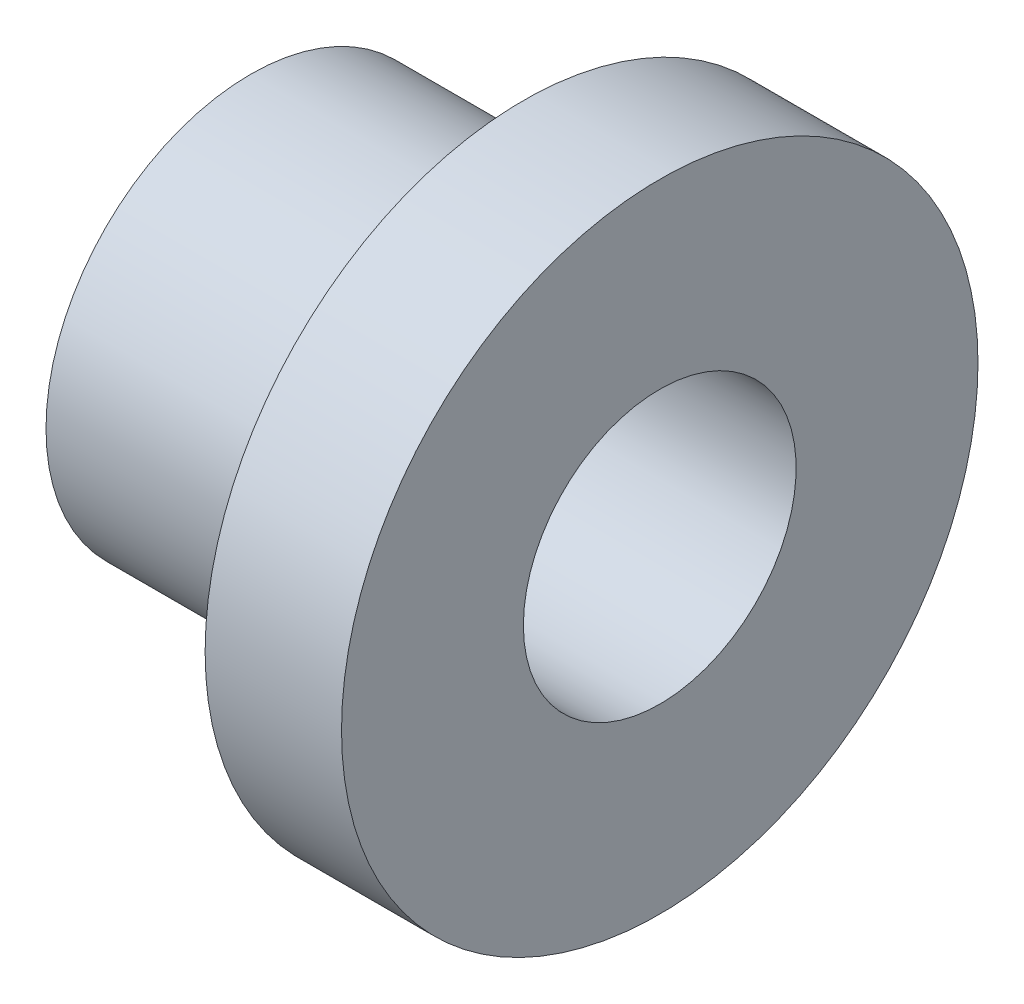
from build123d import *


with BuildPart() as part:
    # Esquisse1 → R_volution1 (revolve)
    with BuildSketch(Plane.XY, mode=Mode.PRIVATE) as r_volution1_sk:
        Polygon((0, 4.5), (6, 4.5), (6, 7), (9, 7), (9, 3), (0, 3), align=None)
    revolve(r_volution1_sk.sketch.rotate(Axis((0, 0, 0), (1, 0, 0)), 90), axis=Axis((0, 0, 0), (1, 0, 0)))


solid = part.part
